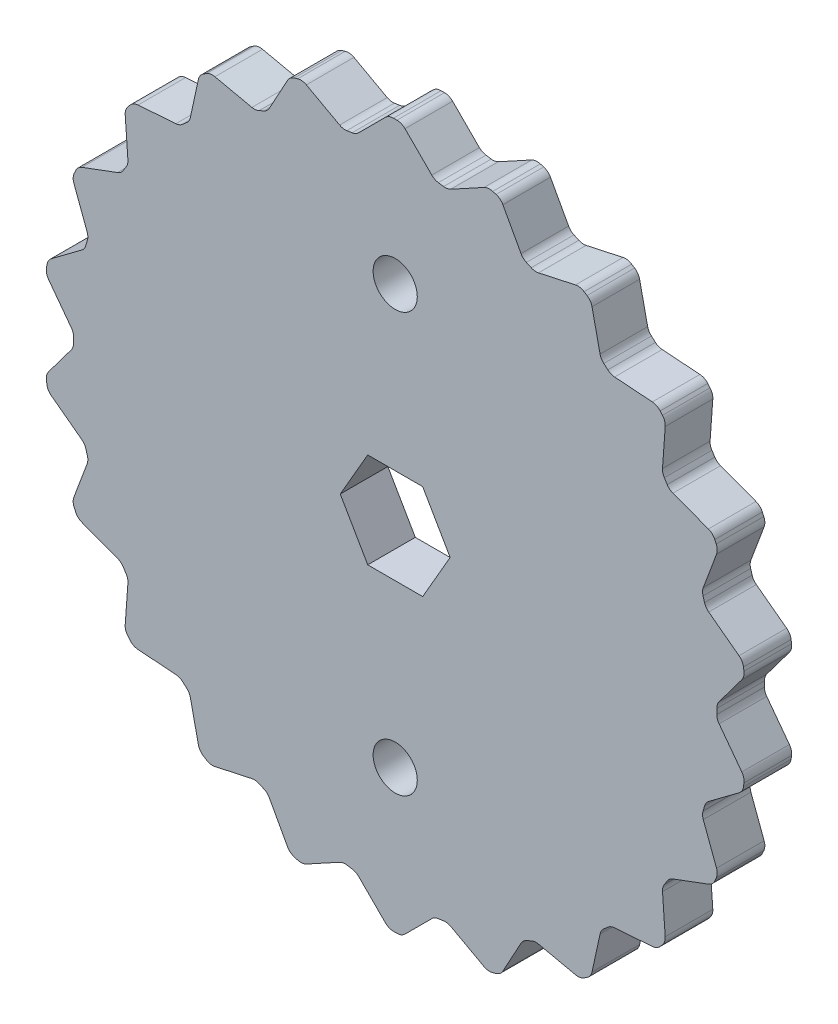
from build123d import *

# Parameters (mm, degrees)
BOSS_EXTRUDE1_DEPTH      = 3.175
SKETCH3_R                = 21.456937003
BOSS_EXTRUDE2_DEPTH      = 3.175
FILLET1_R                = 0.762
CIRPATTERN1_COUNT        = 22
FILLET1_OF_CIRPATTERN1_R = 0.762
CUT_EXTRUDE1_DEPTH       = 34.218917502
F_4_CLEARANCE_HOLE1_D    = 2.9464


with BuildPart() as part:
    # Sketch2 → Boss-Extrude1 (new body)
    with BuildSketch(Plane.XY):
        with BuildLine():
            Line((0.4318, 23.488937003), (-0.4318, 23.488937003))
            Line((-0.4318, 23.488937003), (-2.62497038, 21.295766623))
            ThreePointArc((-2.62497038, 21.295766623), (-2.839112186, 21.268276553), (-3.05296655, 21.238633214))
            ThreePointArc((-3.05296655, 21.238633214), (0, 18.396175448), (3.05296655, 21.238633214))
            ThreePointArc((3.05296655, 21.238633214), (2.839112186, 21.268276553), (2.62497038, 21.295766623))
            Line((2.62497038, 21.295766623), (0.4318, 23.488937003))
        make_face()
    boss_extrude1 = extrude(amount=BOSS_EXTRUDE1_DEPTH)

    # Sketch3 → Boss-Extrude2 (add)
    with BuildSketch(Plane.XY):
        Circle(SKETCH3_R)
    extrude(amount=BOSS_EXTRUDE2_DEPTH)

    # Fillet1
    fillet1_edges = [part.edges().sort_by_distance(p)[0] for p in [
        (-2.62497038, 21.295766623, 1.5875),
        (-0.4318, 23.488937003, 1.5875),
        (0.4318, 23.488937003, 1.5875),
        (2.62497038, 21.295766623, 1.5875),
    ]]
    fillet(fillet1_edges, radius=FILLET1_R)

    # CirPattern1: Boss-Extrude1 ×22 about axis
    cirpattern1_axis = Axis((0, 0, 0), (0, 0, 1))
    for i in range(1, CIRPATTERN1_COUNT):
        add(boss_extrude1.rotate(cirpattern1_axis, i * 360 / CIRPATTERN1_COUNT))

    # Fillet1 of CirPattern1
    fillet1_of_cirpattern1_edges = [part.edges().sort_by_distance(p)[0] for p in [
        (-8.518351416, 19.693598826, 1.5875),
        (-7.031907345, 22.415817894, 1.5875),
        (-6.203289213, 22.65912213, 1.5875),
        (-3.481070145, 21.172678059, 1.5875),
        (-13.721626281, 16.495972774, 1.5875),
        (-13.062331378, 19.526702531, 1.5875),
        (-12.335824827, 19.993599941, 1.5875),
        (-9.305095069, 19.334305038, 1.5875),
        (-17.81325659, 11.961941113, 1.5875),
        (-18.034523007, 15.055649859, 1.5875),
        (-17.468985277, 15.708315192, 1.5875),
        (-14.375276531, 15.929581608, 1.5875),
        (-20.46176279, 6.458824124, 1.5875),
        (-21.545664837, 9.364877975, 1.5875),
        (-21.186912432, 10.150436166, 1.5875),
        (-18.280858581, 11.234338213, 1.5875),
        (-21.45257866, 0.432451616, 1.5875),
        (-23.31130504, 2.915419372, 1.5875),
        (-23.188401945, 3.770229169, 1.5875),
        (-20.705434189, 5.628955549, 1.5875),
        (-20.705434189, -5.628955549, 1.5875),
        (-23.188401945, -3.770229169, 1.5875),
        (-23.31130504, -2.915419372, 1.5875),
        (-21.45257866, -0.432451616, 1.5875),
        (-18.280858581, -11.234338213, 1.5875),
        (-21.186912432, -10.150436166, 1.5875),
        (-21.545664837, -9.364877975, 1.5875),
        (-20.46176279, -6.458824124, 1.5875),
        (-14.375276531, -15.929581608, 1.5875),
        (-17.468985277, -15.708315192, 1.5875),
        (-18.034523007, -15.055649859, 1.5875),
        (-17.81325659, -11.961941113, 1.5875),
        (-9.305095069, -19.334305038, 1.5875),
        (-12.335824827, -19.993599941, 1.5875),
        (-13.062331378, -19.526702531, 1.5875),
        (-13.721626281, -16.495972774, 1.5875),
        (-3.481070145, -21.172678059, 1.5875),
        (-6.203289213, -22.65912213, 1.5875),
        (-7.031907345, -22.415817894, 1.5875),
        (-8.518351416, -19.693598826, 1.5875),
        (2.62497038, -21.295766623, 1.5875),
        (0.4318, -23.488937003, 1.5875),
        (-0.4318, -23.488937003, 1.5875),
        (-2.62497038, -21.295766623, 1.5875),
        (8.518351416, -19.693598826, 1.5875),
        (7.031907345, -22.415817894, 1.5875),
        (6.203289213, -22.65912213, 1.5875),
        (3.481070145, -21.172678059, 1.5875),
        (13.721626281, -16.495972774, 1.5875),
        (13.062331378, -19.526702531, 1.5875),
        (12.335824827, -19.993599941, 1.5875),
        (9.305095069, -19.334305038, 1.5875),
        (17.81325659, -11.961941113, 1.5875),
        (18.034523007, -15.055649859, 1.5875),
        (17.468985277, -15.708315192, 1.5875),
        (14.375276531, -15.929581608, 1.5875),
        (20.46176279, -6.458824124, 1.5875),
        (21.545664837, -9.364877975, 1.5875),
        (21.186912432, -10.150436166, 1.5875),
        (18.280858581, -11.234338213, 1.5875),
        (21.45257866, -0.432451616, 1.5875),
        (23.31130504, -2.915419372, 1.5875),
        (23.188401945, -3.770229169, 1.5875),
        (20.705434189, -5.628955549, 1.5875),
        (20.705434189, 5.628955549, 1.5875),
        (23.188401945, 3.770229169, 1.5875),
        (23.31130504, 2.915419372, 1.5875),
        (21.45257866, 0.432451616, 1.5875),
        (18.280858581, 11.234338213, 1.5875),
        (21.186912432, 10.150436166, 1.5875),
        (21.545664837, 9.364877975, 1.5875),
        (20.46176279, 6.458824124, 1.5875),
        (14.375276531, 15.929581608, 1.5875),
        (17.468985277, 15.708315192, 1.5875),
        (18.034523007, 15.055649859, 1.5875),
        (17.81325659, 11.961941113, 1.5875),
        (9.305095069, 19.334305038, 1.5875),
        (12.335824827, 19.993599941, 1.5875),
        (13.062331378, 19.526702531, 1.5875),
        (13.721626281, 16.495972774, 1.5875),
        (3.481070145, 21.172678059, 1.5875),
        (6.203289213, 22.65912213, 1.5875),
        (7.031907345, 22.415817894, 1.5875),
        (8.518351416, 19.693598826, 1.5875),
    ]]
    fillet(fillet1_of_cirpattern1_edges, radius=FILLET1_OF_CIRPATTERN1_R)

    # Sketch4 → Cut-Extrude1 (cut, through all)
    with BuildSketch(Plane.XY.offset(3.175)):
        Polygon((1.833087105, -3.175), (3.666174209, 0), (1.833087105, 3.175), (-1.833087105, 3.175), (-3.666174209, 0), (-1.833087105, -3.175), align=None)
    extrude(amount=-CUT_EXTRUDE1_DEPTH, mode=Mode.SUBTRACT)

    # 4 Clearance Hole1 (through all)
    with Locations(Plane.XY.offset(3.175)):
        with Locations((0, 13.97), (0, -13.97)):
            Hole(F_4_CLEARANCE_HOLE1_D / 2)


solid = part.part
